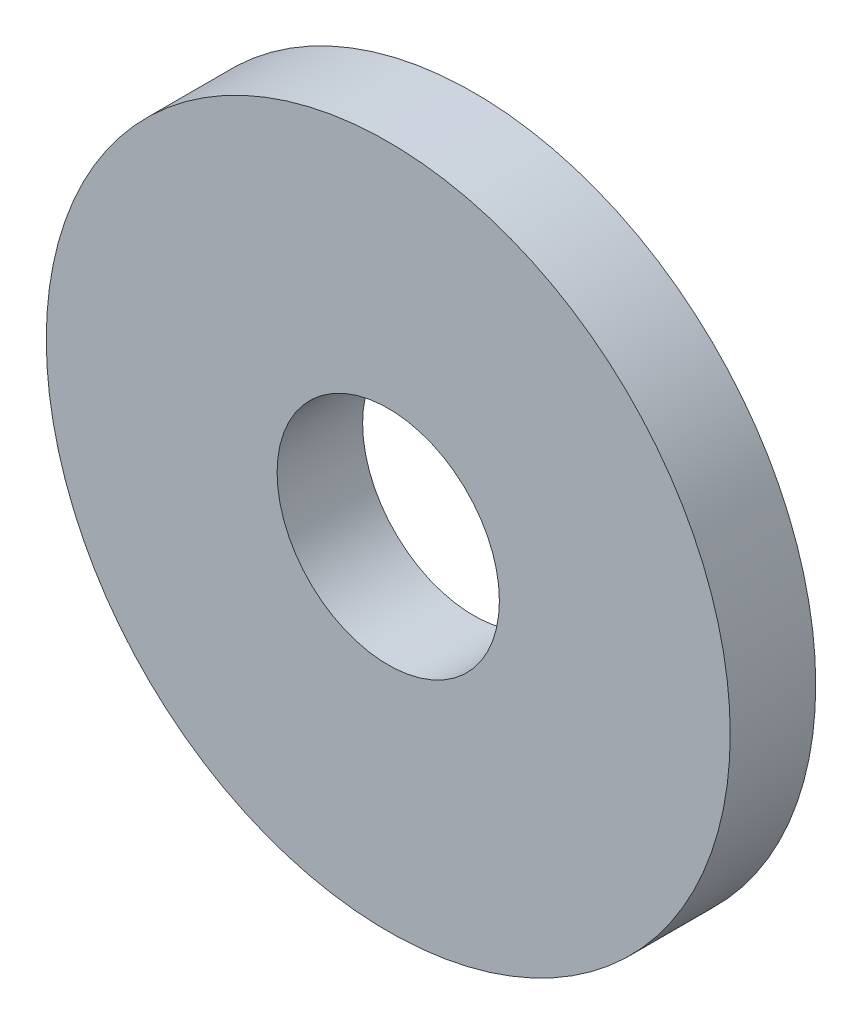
ISO-10303-21;
HEADER;
FILE_DESCRIPTION(('STEP AP214'),'2;1');
FILE_NAME('part.step','',(''),(''),'','','');
FILE_SCHEMA(('AUTOMOTIVE_DESIGN { 1 0 10303 214 1 1 1 1 }'));
ENDSEC;
DATA;
#1=APPLICATION_CONTEXT('core data for automotive mechanical design processes');
#2=APPLICATION_PROTOCOL_DEFINITION('international standard','automotive_design',2000,#1);
#3=PRODUCT_CONTEXT('',#1,'mechanical');
#4=PRODUCT('Part','Part','',(#3));
#5=PRODUCT_RELATED_PRODUCT_CATEGORY('part','',(#4));
#6=PRODUCT_DEFINITION_FORMATION('','',#4);
#7=PRODUCT_DEFINITION_CONTEXT('part definition',#1,'design');
#8=PRODUCT_DEFINITION('design','',#6,#7);
#9=PRODUCT_DEFINITION_SHAPE('','',#8);
#10=(LENGTH_UNIT() NAMED_UNIT(*) SI_UNIT(.MILLI.,.METRE.));
#11=(NAMED_UNIT(*) PLANE_ANGLE_UNIT() SI_UNIT($,.RADIAN.));
#12=(NAMED_UNIT(*) SI_UNIT($,.STERADIAN.) SOLID_ANGLE_UNIT());
#13=UNCERTAINTY_MEASURE_WITH_UNIT(LENGTH_MEASURE(1.E-05),#10,'distance_accuracy_value','');
#14=(GEOMETRIC_REPRESENTATION_CONTEXT(3) GLOBAL_UNCERTAINTY_ASSIGNED_CONTEXT((#13)) GLOBAL_UNIT_ASSIGNED_CONTEXT((#10,
#11,#12)) REPRESENTATION_CONTEXT('',''));
#15=CARTESIAN_POINT('',(0.,0.,0.));
#16=DIRECTION('',(0.,0.,1.));
#17=DIRECTION('',(1.,0.,0.));
#18=AXIS2_PLACEMENT_3D('',#15,#16,#17);
#19=CARTESIAN_POINT('',(0.,0.,5.));
#20=DIRECTION('',(0.,0.,1.));
#21=DIRECTION('',(1.,0.,0.));
#22=AXIS2_PLACEMENT_3D('',#19,#20,#21);
#23=PLANE('',#22);
#24=CARTESIAN_POINT('',(0.,0.,5.));
#25=DIRECTION('',(0.,0.,1.));
#26=DIRECTION('',(1.,0.,0.));
#27=AXIS2_PLACEMENT_3D('',#24,#25,#26);
#28=CIRCLE('',#27,20.);
#29=CARTESIAN_POINT('',(20.,0.,5.));
#30=VERTEX_POINT('',#29);
#31=EDGE_CURVE('E8',#30,#30,#28,.T.);
#32=ORIENTED_EDGE('',*,*,#31,.T.);
#33=EDGE_LOOP('',(#32));
#34=FACE_BOUND('',#33,.T.);
#35=CARTESIAN_POINT('',(0.,0.,5.));
#36=DIRECTION('',(0.,0.,1.));
#37=DIRECTION('',(1.,0.,0.));
#38=AXIS2_PLACEMENT_3D('',#35,#36,#37);
#39=CIRCLE('',#38,6.5);
#40=CARTESIAN_POINT('',(6.5,0.,5.));
#41=VERTEX_POINT('',#40);
#42=EDGE_CURVE('E23',#41,#41,#39,.T.);
#43=ORIENTED_EDGE('',*,*,#42,.F.);
#44=EDGE_LOOP('',(#43));
#45=FACE_BOUND('',#44,.T.);
#46=ADVANCED_FACE('F12',(#34,#45),#23,.T.);
#47=CARTESIAN_POINT('',(0.,0.,0.));
#48=DIRECTION('',(0.,0.,1.));
#49=DIRECTION('',(1.,0.,0.));
#50=AXIS2_PLACEMENT_3D('',#47,#48,#49);
#51=PLANE('',#50);
#52=CARTESIAN_POINT('',(0.,0.,0.));
#53=DIRECTION('',(0.,0.,1.));
#54=DIRECTION('',(1.,0.,0.));
#55=AXIS2_PLACEMENT_3D('',#52,#53,#54);
#56=CIRCLE('',#55,20.);
#57=CARTESIAN_POINT('',(20.,0.,0.));
#58=VERTEX_POINT('',#57);
#59=EDGE_CURVE('E19',#58,#58,#56,.T.);
#60=ORIENTED_EDGE('',*,*,#59,.F.);
#61=EDGE_LOOP('',(#60));
#62=FACE_BOUND('',#61,.T.);
#63=CARTESIAN_POINT('',(0.,0.,0.));
#64=DIRECTION('',(0.,0.,1.));
#65=DIRECTION('',(1.,0.,0.));
#66=AXIS2_PLACEMENT_3D('',#63,#64,#65);
#67=CIRCLE('',#66,6.5);
#68=CARTESIAN_POINT('',(6.5,0.,0.));
#69=VERTEX_POINT('',#68);
#70=EDGE_CURVE('E27',#69,#69,#67,.T.);
#71=ORIENTED_EDGE('',*,*,#70,.T.);
#72=EDGE_LOOP('',(#71));
#73=FACE_BOUND('',#72,.T.);
#74=ADVANCED_FACE('F33',(#62,#73),#51,.F.);
#75=CARTESIAN_POINT('',(0.,0.,5.));
#76=DIRECTION('',(0.,0.,-1.));
#77=DIRECTION('',(-1.,0.,0.));
#78=AXIS2_PLACEMENT_3D('',#75,#76,#77);
#79=CYLINDRICAL_SURFACE('',#78,20.);
#80=ORIENTED_EDGE('',*,*,#31,.F.);
#81=EDGE_LOOP('',(#80));
#82=FACE_BOUND('',#81,.T.);
#83=ORIENTED_EDGE('',*,*,#59,.T.);
#84=EDGE_LOOP('',(#83));
#85=FACE_BOUND('',#84,.T.);
#86=ADVANCED_FACE('F14',(#82,#85),#79,.T.);
#87=CARTESIAN_POINT('',(0.,0.,5.));
#88=DIRECTION('',(0.,0.,-1.));
#89=DIRECTION('',(-1.,0.,0.));
#90=AXIS2_PLACEMENT_3D('',#87,#88,#89);
#91=CYLINDRICAL_SURFACE('',#90,6.5);
#92=ORIENTED_EDGE('',*,*,#42,.T.);
#93=EDGE_LOOP('',(#92));
#94=FACE_BOUND('',#93,.T.);
#95=ORIENTED_EDGE('',*,*,#70,.F.);
#96=EDGE_LOOP('',(#95));
#97=FACE_BOUND('',#96,.T.);
#98=ADVANCED_FACE('F35',(#94,#97),#91,.F.);
#99=CLOSED_SHELL('',(#46,#74,#86,#98));
#100=MANIFOLD_SOLID_BREP('B1',#99);
#101=ADVANCED_BREP_SHAPE_REPRESENTATION('',(#18,#100),#14);
#102=SHAPE_DEFINITION_REPRESENTATION(#9,#101);
ENDSEC;
END-ISO-10303-21;
